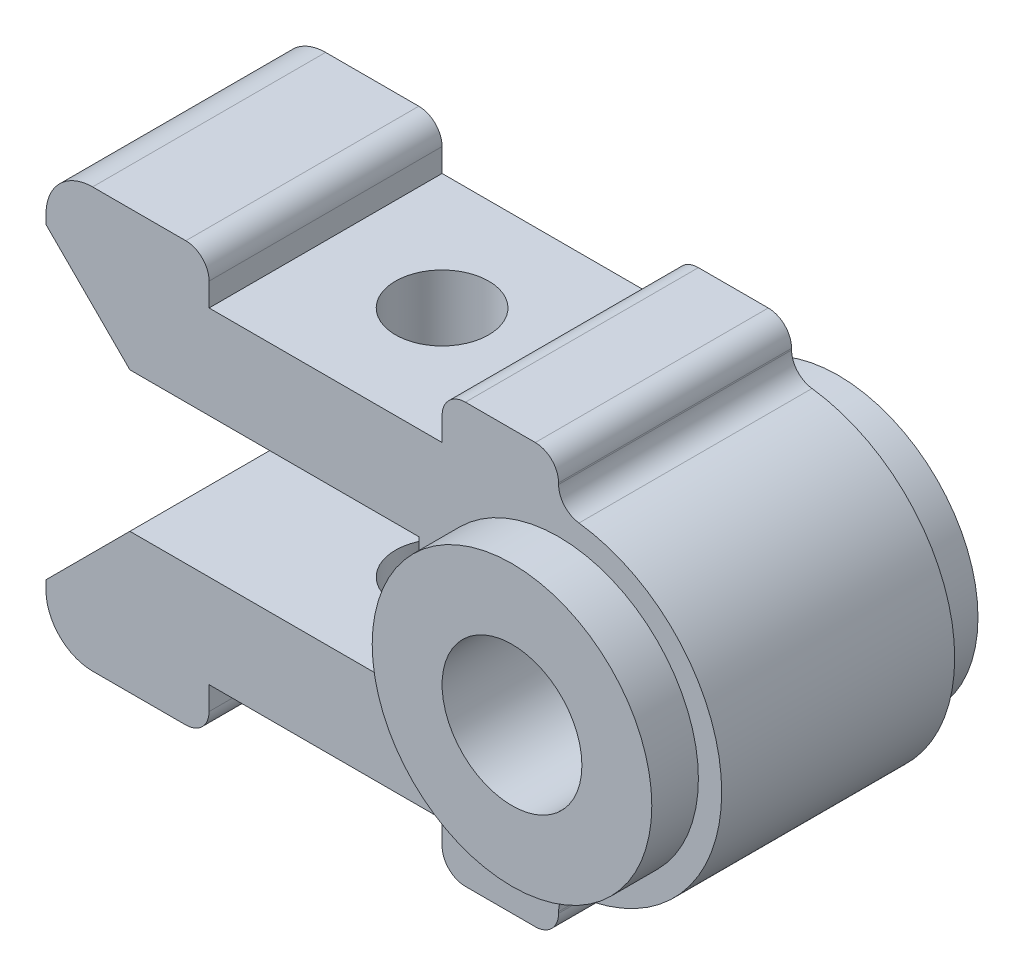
ISO-10303-21;
HEADER;
FILE_DESCRIPTION(('STEP AP214'),'2;1');
FILE_NAME('part.step','',(''),(''),'','','');
FILE_SCHEMA(('AUTOMOTIVE_DESIGN { 1 0 10303 214 1 1 1 1 }'));
ENDSEC;
DATA;
#1=APPLICATION_CONTEXT('core data for automotive mechanical design processes');
#2=APPLICATION_PROTOCOL_DEFINITION('international standard','automotive_design',2000,#1);
#3=PRODUCT_CONTEXT('',#1,'mechanical');
#4=PRODUCT('Part','Part','',(#3));
#5=PRODUCT_RELATED_PRODUCT_CATEGORY('part','',(#4));
#6=PRODUCT_DEFINITION_FORMATION('','',#4);
#7=PRODUCT_DEFINITION_CONTEXT('part definition',#1,'design');
#8=PRODUCT_DEFINITION('design','',#6,#7);
#9=PRODUCT_DEFINITION_SHAPE('','',#8);
#10=(LENGTH_UNIT() NAMED_UNIT(*) SI_UNIT(.MILLI.,.METRE.));
#11=(NAMED_UNIT(*) PLANE_ANGLE_UNIT() SI_UNIT($,.RADIAN.));
#12=(NAMED_UNIT(*) SI_UNIT($,.STERADIAN.) SOLID_ANGLE_UNIT());
#13=UNCERTAINTY_MEASURE_WITH_UNIT(LENGTH_MEASURE(1.E-05),#10,'distance_accuracy_value','');
#14=(GEOMETRIC_REPRESENTATION_CONTEXT(3) GLOBAL_UNCERTAINTY_ASSIGNED_CONTEXT((#13)) GLOBAL_UNIT_ASSIGNED_CONTEXT((#10,
#11,#12)) REPRESENTATION_CONTEXT('',''));
#15=CARTESIAN_POINT('',(0.,0.,0.));
#16=DIRECTION('',(0.,0.,1.));
#17=DIRECTION('',(1.,0.,0.));
#18=AXIS2_PLACEMENT_3D('',#15,#16,#17);
#19=CARTESIAN_POINT('',(0.,0.,2.5));
#20=DIRECTION('',(0.,0.,1.));
#21=DIRECTION('',(1.,0.,0.));
#22=AXIS2_PLACEMENT_3D('',#19,#20,#21);
#23=PLANE('',#22);
#24=DIRECTION('',(0.,-1.,0.));
#25=VECTOR('',#24,1.);
#26=CARTESIAN_POINT('',(2.5,0.,2.5));
#27=LINE('',#26,#25);
#28=CARTESIAN_POINT('',(2.5,1.5,2.5));
#29=VERTEX_POINT('',#28);
#30=CARTESIAN_POINT('',(2.5,0.,2.5));
#31=VERTEX_POINT('',#30);
#32=EDGE_CURVE('E310',#29,#31,#27,.T.);
#33=ORIENTED_EDGE('',*,*,#32,.T.);
#34=CARTESIAN_POINT('',(5.5,0.,2.5));
#35=DIRECTION('',(0.,0.,1.));
#36=DIRECTION('',(1.,0.,0.));
#37=AXIS2_PLACEMENT_3D('',#34,#35,#36);
#38=CIRCLE('',#37,3.);
#39=EDGE_CURVE('E60',#31,#31,#38,.T.);
#40=ORIENTED_EDGE('',*,*,#39,.F.);
#41=CARTESIAN_POINT('',(2.5,-1.5,2.5));
#42=VERTEX_POINT('',#41);
#43=EDGE_CURVE('E309',#31,#42,#27,.T.);
#44=ORIENTED_EDGE('',*,*,#43,.T.);
#45=DIRECTION('',(1.,0.,0.));
#46=VECTOR('',#45,1.);
#47=CARTESIAN_POINT('',(0.,-1.5,2.5));
#48=LINE('',#47,#46);
#49=CARTESIAN_POINT('',(-3.70000000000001,-1.5,2.5));
#50=VERTEX_POINT('',#49);
#51=EDGE_CURVE('E313',#50,#42,#48,.T.);
#52=ORIENTED_EDGE('',*,*,#51,.F.);
#53=DIRECTION('',(0.707106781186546,0.707106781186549,0.));
#54=VECTOR('',#53,1.);
#55=CARTESIAN_POINT('',(-1.10000000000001,1.10000000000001,2.5));
#56=LINE('',#55,#54);
#57=CARTESIAN_POINT('',(-5.5,-3.3,2.5));
#58=VERTEX_POINT('',#57);
#59=EDGE_CURVE('E316',#58,#50,#56,.T.);
#60=ORIENTED_EDGE('',*,*,#59,.F.);
#61=DIRECTION('',(0.,-1.,0.));
#62=VECTOR('',#61,1.);
#63=CARTESIAN_POINT('',(-5.5,0.,2.5));
#64=LINE('',#63,#62);
#65=CARTESIAN_POINT('',(-5.5,-3.5,2.5));
#66=VERTEX_POINT('',#65);
#67=EDGE_CURVE('E319',#58,#66,#64,.T.);
#68=ORIENTED_EDGE('',*,*,#67,.T.);
#69=CARTESIAN_POINT('',(-4.5,-3.5,2.5));
#70=DIRECTION('',(0.,0.,1.));
#71=DIRECTION('',(1.,0.,0.));
#72=AXIS2_PLACEMENT_3D('',#69,#70,#71);
#73=CIRCLE('',#72,1.);
#74=CARTESIAN_POINT('',(-4.5,-4.5,2.5));
#75=VERTEX_POINT('',#74);
#76=EDGE_CURVE('E402',#66,#75,#73,.T.);
#77=ORIENTED_EDGE('',*,*,#76,.T.);
#78=DIRECTION('',(-1.,0.,0.));
#79=VECTOR('',#78,1.);
#80=CARTESIAN_POINT('',(0.,-4.5,2.5));
#81=LINE('',#80,#79);
#82=CARTESIAN_POINT('',(-2.5,-4.5,2.5));
#83=VERTEX_POINT('',#82);
#84=EDGE_CURVE('E322',#83,#75,#81,.T.);
#85=ORIENTED_EDGE('',*,*,#84,.F.);
#86=CARTESIAN_POINT('',(-2.5,-4.,2.5));
#87=DIRECTION('',(0.,0.,1.));
#88=DIRECTION('',(1.,0.,0.));
#89=AXIS2_PLACEMENT_3D('',#86,#87,#88);
#90=CIRCLE('',#89,0.5);
#91=CARTESIAN_POINT('',(-2.,-4.,2.5));
#92=VERTEX_POINT('',#91);
#93=EDGE_CURVE('E438',#83,#92,#90,.T.);
#94=ORIENTED_EDGE('',*,*,#93,.T.);
#95=DIRECTION('',(0.,-1.,0.));
#96=VECTOR('',#95,1.);
#97=CARTESIAN_POINT('',(-2.,-4.5,2.5));
#98=LINE('',#97,#96);
#99=CARTESIAN_POINT('',(-2.,-3.5,2.5));
#100=VERTEX_POINT('',#99);
#101=EDGE_CURVE('E292',#100,#92,#98,.T.);
#102=ORIENTED_EDGE('',*,*,#101,.F.);
#103=DIRECTION('',(-1.,0.,0.));
#104=VECTOR('',#103,1.);
#105=CARTESIAN_POINT('',(-2.,-3.5,2.5));
#106=LINE('',#105,#104);
#107=CARTESIAN_POINT('',(3.,-3.5,2.5));
#108=VERTEX_POINT('',#107);
#109=EDGE_CURVE('E286',#108,#100,#106,.T.);
#110=ORIENTED_EDGE('',*,*,#109,.F.);
#111=DIRECTION('',(0.,1.,0.));
#112=VECTOR('',#111,1.);
#113=CARTESIAN_POINT('',(3.,-4.5,2.5));
#114=LINE('',#113,#112);
#115=CARTESIAN_POINT('',(3.,-4.,2.5));
#116=VERTEX_POINT('',#115);
#117=EDGE_CURVE('E295',#116,#108,#114,.T.);
#118=ORIENTED_EDGE('',*,*,#117,.F.);
#119=CARTESIAN_POINT('',(3.5,-4.,2.5));
#120=DIRECTION('',(0.,0.,1.));
#121=DIRECTION('',(1.,0.,0.));
#122=AXIS2_PLACEMENT_3D('',#119,#120,#121);
#123=CIRCLE('',#122,0.5);
#124=CARTESIAN_POINT('',(3.5,-4.5,2.5));
#125=VERTEX_POINT('',#124);
#126=EDGE_CURVE('E436',#116,#125,#123,.T.);
#127=ORIENTED_EDGE('',*,*,#126,.T.);
#128=CARTESIAN_POINT('',(5.,-4.5,2.5));
#129=VERTEX_POINT('',#128);
#130=EDGE_CURVE('E324',#129,#125,#81,.T.);
#131=ORIENTED_EDGE('',*,*,#130,.F.);
#132=CARTESIAN_POINT('',(5.,-4.,2.5));
#133=DIRECTION('',(0.,0.,1.));
#134=DIRECTION('',(1.,0.,0.));
#135=AXIS2_PLACEMENT_3D('',#132,#133,#134);
#136=CIRCLE('',#135,0.5);
#137=CARTESIAN_POINT('',(5.5,-4.,2.5));
#138=VERTEX_POINT('',#137);
#139=EDGE_CURVE('E446',#129,#138,#136,.T.);
#140=ORIENTED_EDGE('',*,*,#139,.T.);
#141=DIRECTION('',(0.,-1.,0.));
#142=VECTOR('',#141,1.);
#143=CARTESIAN_POINT('',(5.5,0.,2.5));
#144=LINE('',#143,#142);
#145=CARTESIAN_POINT('',(5.5,-3.96862696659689,2.5));
#146=VERTEX_POINT('',#145);
#147=EDGE_CURVE('E325',#146,#138,#144,.T.);
#148=ORIENTED_EDGE('',*,*,#147,.F.);
#149=CARTESIAN_POINT('',(6.,-3.96862696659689,2.5));
#150=DIRECTION('',(0.,0.,1.));
#151=DIRECTION('',(1.,0.,0.));
#152=AXIS2_PLACEMENT_3D('',#149,#150,#151);
#153=CIRCLE('',#152,0.5);
#154=CARTESIAN_POINT('',(5.9375,-3.47254859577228,2.5));
#155=VERTEX_POINT('',#154);
#156=EDGE_CURVE('E480',#146,#155,#153,.F.);
#157=ORIENTED_EDGE('',*,*,#156,.T.);
#158=CARTESIAN_POINT('',(5.5,0.,2.5));
#159=DIRECTION('',(0.,0.,1.));
#160=DIRECTION('',(1.,0.,0.));
#161=AXIS2_PLACEMENT_3D('',#158,#159,#160);
#162=CIRCLE('',#161,3.5);
#163=CARTESIAN_POINT('',(5.9375,3.47254859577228,2.5));
#164=VERTEX_POINT('',#163);
#165=EDGE_CURVE('E328',#155,#164,#162,.T.);
#166=ORIENTED_EDGE('',*,*,#165,.T.);
#167=CARTESIAN_POINT('',(6.,3.96862696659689,2.5));
#168=DIRECTION('',(0.,0.,1.));
#169=DIRECTION('',(1.,0.,0.));
#170=AXIS2_PLACEMENT_3D('',#167,#168,#169);
#171=CIRCLE('',#170,0.5);
#172=CARTESIAN_POINT('',(5.5,3.96862696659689,2.5));
#173=VERTEX_POINT('',#172);
#174=EDGE_CURVE('E11',#164,#173,#171,.F.);
#175=ORIENTED_EDGE('',*,*,#174,.T.);
#176=DIRECTION('',(0.,-1.,0.));
#177=VECTOR('',#176,1.);
#178=CARTESIAN_POINT('',(5.5,0.,2.5));
#179=LINE('',#178,#177);
#180=CARTESIAN_POINT('',(5.5,4.,2.5));
#181=VERTEX_POINT('',#180);
#182=EDGE_CURVE('E331',#181,#173,#179,.T.);
#183=ORIENTED_EDGE('',*,*,#182,.F.);
#184=CARTESIAN_POINT('',(5.,4.,2.5));
#185=DIRECTION('',(0.,0.,1.));
#186=DIRECTION('',(1.,0.,0.));
#187=AXIS2_PLACEMENT_3D('',#184,#185,#186);
#188=CIRCLE('',#187,0.5);
#189=CARTESIAN_POINT('',(5.,4.5,2.5));
#190=VERTEX_POINT('',#189);
#191=EDGE_CURVE('E444',#181,#190,#188,.T.);
#192=ORIENTED_EDGE('',*,*,#191,.T.);
#193=DIRECTION('',(-1.,0.,0.));
#194=VECTOR('',#193,1.);
#195=CARTESIAN_POINT('',(0.,4.5,2.5));
#196=LINE('',#195,#194);
#197=CARTESIAN_POINT('',(3.5,4.5,2.5));
#198=VERTEX_POINT('',#197);
#199=EDGE_CURVE('E335',#190,#198,#196,.T.);
#200=ORIENTED_EDGE('',*,*,#199,.T.);
#201=CARTESIAN_POINT('',(3.5,4.,2.5));
#202=DIRECTION('',(0.,0.,1.));
#203=DIRECTION('',(1.,0.,0.));
#204=AXIS2_PLACEMENT_3D('',#201,#202,#203);
#205=CIRCLE('',#204,0.5);
#206=CARTESIAN_POINT('',(3.,4.,2.5));
#207=VERTEX_POINT('',#206);
#208=EDGE_CURVE('E440',#198,#207,#205,.T.);
#209=ORIENTED_EDGE('',*,*,#208,.T.);
#210=DIRECTION('',(0.,1.,0.));
#211=VECTOR('',#210,1.);
#212=CARTESIAN_POINT('',(3.,4.5,2.5));
#213=LINE('',#212,#211);
#214=CARTESIAN_POINT('',(3.,3.5,2.5));
#215=VERTEX_POINT('',#214);
#216=EDGE_CURVE('E255',#215,#207,#213,.T.);
#217=ORIENTED_EDGE('',*,*,#216,.F.);
#218=DIRECTION('',(1.,0.,0.));
#219=VECTOR('',#218,1.);
#220=CARTESIAN_POINT('',(-2.,3.5,2.5));
#221=LINE('',#220,#219);
#222=CARTESIAN_POINT('',(-2.,3.5,2.5));
#223=VERTEX_POINT('',#222);
#224=EDGE_CURVE('E275',#223,#215,#221,.T.);
#225=ORIENTED_EDGE('',*,*,#224,.F.);
#226=DIRECTION('',(0.,-1.,0.));
#227=VECTOR('',#226,1.);
#228=CARTESIAN_POINT('',(-2.,4.5,2.5));
#229=LINE('',#228,#227);
#230=CARTESIAN_POINT('',(-2.,4.,2.5));
#231=VERTEX_POINT('',#230);
#232=EDGE_CURVE('E261',#231,#223,#229,.T.);
#233=ORIENTED_EDGE('',*,*,#232,.F.);
#234=CARTESIAN_POINT('',(-2.5,4.,2.5));
#235=DIRECTION('',(0.,0.,1.));
#236=DIRECTION('',(1.,0.,0.));
#237=AXIS2_PLACEMENT_3D('',#234,#235,#236);
#238=CIRCLE('',#237,0.5);
#239=CARTESIAN_POINT('',(-2.5,4.5,2.5));
#240=VERTEX_POINT('',#239);
#241=EDGE_CURVE('E442',#231,#240,#238,.T.);
#242=ORIENTED_EDGE('',*,*,#241,.T.);
#243=CARTESIAN_POINT('',(-4.5,4.5,2.5));
#244=VERTEX_POINT('',#243);
#245=EDGE_CURVE('E334',#240,#244,#196,.T.);
#246=ORIENTED_EDGE('',*,*,#245,.T.);
#247=CARTESIAN_POINT('',(-4.5,3.5,2.5));
#248=DIRECTION('',(0.,0.,1.));
#249=DIRECTION('',(1.,0.,0.));
#250=AXIS2_PLACEMENT_3D('',#247,#248,#249);
#251=CIRCLE('',#250,1.);
#252=CARTESIAN_POINT('',(-5.5,3.5,2.5));
#253=VERTEX_POINT('',#252);
#254=EDGE_CURVE('E400',#244,#253,#251,.T.);
#255=ORIENTED_EDGE('',*,*,#254,.T.);
#256=DIRECTION('',(0.,-1.,0.));
#257=VECTOR('',#256,1.);
#258=CARTESIAN_POINT('',(-5.5,0.,2.5));
#259=LINE('',#258,#257);
#260=CARTESIAN_POINT('',(-5.5,3.29999999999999,2.5));
#261=VERTEX_POINT('',#260);
#262=EDGE_CURVE('E338',#253,#261,#259,.T.);
#263=ORIENTED_EDGE('',*,*,#262,.T.);
#264=DIRECTION('',(0.707106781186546,-0.707106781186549,0.));
#265=VECTOR('',#264,1.);
#266=CARTESIAN_POINT('',(-1.10000000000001,-1.10000000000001,2.5));
#267=LINE('',#266,#265);
#268=CARTESIAN_POINT('',(-3.70000000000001,1.5,2.5));
#269=VERTEX_POINT('',#268);
#270=EDGE_CURVE('E303',#261,#269,#267,.T.);
#271=ORIENTED_EDGE('',*,*,#270,.T.);
#272=DIRECTION('',(1.,0.,0.));
#273=VECTOR('',#272,1.);
#274=CARTESIAN_POINT('',(0.,1.5,2.5));
#275=LINE('',#274,#273);
#276=EDGE_CURVE('E306',#269,#29,#275,.T.);
#277=ORIENTED_EDGE('',*,*,#276,.T.);
#278=EDGE_LOOP('',(#33,#40,#44,#52,#60,#68,#77,#85,#94,#102,#110,#118,#127,#131,#140,#148,#157,
#166,#175,#183,#192,#200,#209,#217,#225,#233,#242,#246,#255,#263,#271,#277));
#279=FACE_BOUND('',#278,.T.);
#280=ADVANCED_FACE('F42',(#279),#23,.T.);
#281=CARTESIAN_POINT('',(0.,-4.5,2.5));
#282=DIRECTION('',(0.,-1.,0.));
#283=DIRECTION('',(0.,0.,-1.));
#284=AXIS2_PLACEMENT_3D('',#281,#282,#283);
#285=PLANE('',#284);
#286=DIRECTION('',(-1.,0.,0.));
#287=VECTOR('',#286,1.);
#288=CARTESIAN_POINT('',(0.,-4.5,-2.5));
#289=LINE('',#288,#287);
#290=CARTESIAN_POINT('',(-2.5,-4.5,-2.5));
#291=VERTEX_POINT('',#290);
#292=CARTESIAN_POINT('',(-4.5,-4.5,-2.5));
#293=VERTEX_POINT('',#292);
#294=EDGE_CURVE('E358',#291,#293,#289,.T.);
#295=ORIENTED_EDGE('',*,*,#294,.F.);
#296=DIRECTION('',(0.,0.,1.));
#297=VECTOR('',#296,1.);
#298=CARTESIAN_POINT('',(-2.5,-4.5,2.5));
#299=LINE('',#298,#297);
#300=EDGE_CURVE('E470',#291,#83,#299,.T.);
#301=ORIENTED_EDGE('',*,*,#300,.T.);
#302=ORIENTED_EDGE('',*,*,#84,.T.);
#303=DIRECTION('',(0.,0.,-1.));
#304=VECTOR('',#303,1.);
#305=CARTESIAN_POINT('',(-4.5,-4.5,-2.5));
#306=LINE('',#305,#304);
#307=EDGE_CURVE('E390',#75,#293,#306,.T.);
#308=ORIENTED_EDGE('',*,*,#307,.T.);
#309=EDGE_LOOP('',(#295,#301,#302,#308));
#310=FACE_BOUND('',#309,.T.);
#311=ADVANCED_FACE('F532',(#310),#285,.T.);
#312=CARTESIAN_POINT('',(0.,4.5,2.5));
#313=DIRECTION('',(0.,-1.,0.));
#314=DIRECTION('',(1.,0.,0.));
#315=AXIS2_PLACEMENT_3D('',#312,#313,#314);
#316=PLANE('',#315);
#317=ORIENTED_EDGE('',*,*,#245,.F.);
#318=DIRECTION('',(0.,0.,1.));
#319=VECTOR('',#318,1.);
#320=CARTESIAN_POINT('',(-2.5,4.5,2.5));
#321=LINE('',#320,#319);
#322=CARTESIAN_POINT('',(-2.5,4.5,-2.5));
#323=VERTEX_POINT('',#322);
#324=EDGE_CURVE('E466',#240,#323,#321,.F.);
#325=ORIENTED_EDGE('',*,*,#324,.T.);
#326=DIRECTION('',(-1.,0.,0.));
#327=VECTOR('',#326,1.);
#328=CARTESIAN_POINT('',(0.,4.5,-2.5));
#329=LINE('',#328,#327);
#330=CARTESIAN_POINT('',(-4.5,4.5,-2.5));
#331=VERTEX_POINT('',#330);
#332=EDGE_CURVE('E370',#323,#331,#329,.T.);
#333=ORIENTED_EDGE('',*,*,#332,.T.);
#334=DIRECTION('',(0.,0.,-1.));
#335=VECTOR('',#334,1.);
#336=CARTESIAN_POINT('',(-4.5,4.5,2.5));
#337=LINE('',#336,#335);
#338=EDGE_CURVE('E408',#331,#244,#337,.F.);
#339=ORIENTED_EDGE('',*,*,#338,.T.);
#340=EDGE_LOOP('',(#317,#325,#333,#339));
#341=FACE_BOUND('',#340,.T.);
#342=ADVANCED_FACE('F517',(#341),#316,.F.);
#343=CARTESIAN_POINT('',(-1.10000000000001,-1.10000000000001,2.5));
#344=DIRECTION('',(0.707106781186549,0.707106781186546,0.));
#345=DIRECTION('',(-0.707106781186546,0.707106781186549,0.));
#346=AXIS2_PLACEMENT_3D('',#343,#344,#345);
#347=PLANE('',#346);
#348=DIRECTION('',(0.707106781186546,-0.707106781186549,0.));
#349=VECTOR('',#348,1.);
#350=CARTESIAN_POINT('',(-1.10000000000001,-1.10000000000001,-2.5));
#351=LINE('',#350,#349);
#352=CARTESIAN_POINT('',(-5.5,3.29999999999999,-2.5));
#353=VERTEX_POINT('',#352);
#354=CARTESIAN_POINT('',(-3.70000000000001,1.5,-2.5));
#355=VERTEX_POINT('',#354);
#356=EDGE_CURVE('E280',#353,#355,#351,.T.);
#357=ORIENTED_EDGE('',*,*,#356,.T.);
#358=DIRECTION('',(0.,0.,-1.));
#359=VECTOR('',#358,1.);
#360=CARTESIAN_POINT('',(-3.70000000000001,1.5,2.5));
#361=LINE('',#360,#359);
#362=EDGE_CURVE('E387',#269,#355,#361,.T.);
#363=ORIENTED_EDGE('',*,*,#362,.F.);
#364=ORIENTED_EDGE('',*,*,#270,.F.);
#365=DIRECTION('',(0.,0.,-1.));
#366=VECTOR('',#365,1.);
#367=CARTESIAN_POINT('',(-5.5,3.29999999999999,2.5));
#368=LINE('',#367,#366);
#369=EDGE_CURVE('E340',#261,#353,#368,.T.);
#370=ORIENTED_EDGE('',*,*,#369,.T.);
#371=EDGE_LOOP('',(#357,#363,#364,#370));
#372=FACE_BOUND('',#371,.T.);
#373=ADVANCED_FACE('F583',(#372),#347,.F.);
#374=CARTESIAN_POINT('',(0.,1.5,2.5));
#375=DIRECTION('',(0.,1.,0.));
#376=DIRECTION('',(0.,0.,1.));
#377=AXIS2_PLACEMENT_3D('',#374,#375,#376);
#378=PLANE('',#377);
#379=CARTESIAN_POINT('',(0.5,1.5,0.));
#380=DIRECTION('',(0.,1.,0.));
#381=DIRECTION('',(0.,0.,1.));
#382=AXIS2_PLACEMENT_3D('',#379,#380,#381);
#383=CIRCLE('',#382,1.);
#384=CARTESIAN_POINT('',(0.5,1.5,1.));
#385=VERTEX_POINT('',#384);
#386=EDGE_CURVE('E296',#385,#385,#383,.T.);
#387=ORIENTED_EDGE('',*,*,#386,.T.);
#388=EDGE_LOOP('',(#387));
#389=FACE_BOUND('',#388,.T.);
#390=DIRECTION('',(1.,0.,0.));
#391=VECTOR('',#390,1.);
#392=CARTESIAN_POINT('',(0.,1.5,-2.5));
#393=LINE('',#392,#391);
#394=CARTESIAN_POINT('',(2.5,1.5,-2.5));
#395=VERTEX_POINT('',#394);
#396=EDGE_CURVE('E343',#355,#395,#393,.T.);
#397=ORIENTED_EDGE('',*,*,#396,.T.);
#398=DIRECTION('',(0.,0.,-1.));
#399=VECTOR('',#398,1.);
#400=CARTESIAN_POINT('',(2.5,1.5,2.5));
#401=LINE('',#400,#399);
#402=EDGE_CURVE('E384',#29,#395,#401,.T.);
#403=ORIENTED_EDGE('',*,*,#402,.F.);
#404=ORIENTED_EDGE('',*,*,#276,.F.);
#405=ORIENTED_EDGE('',*,*,#362,.T.);
#406=EDGE_LOOP('',(#397,#403,#404,#405));
#407=FACE_BOUND('',#406,.T.);
#408=ADVANCED_FACE('F579',(#389,#407),#378,.F.);
#409=CARTESIAN_POINT('',(2.5,0.,2.5));
#410=DIRECTION('',(1.,0.,0.));
#411=DIRECTION('',(0.,0.,-1.));
#412=AXIS2_PLACEMENT_3D('',#409,#410,#411);
#413=PLANE('',#412);
#414=DIRECTION('',(0.,-1.,0.));
#415=VECTOR('',#414,1.);
#416=CARTESIAN_POINT('',(2.5,0.,-2.5));
#417=LINE('',#416,#415);
#418=CARTESIAN_POINT('',(2.5,0.,-2.5));
#419=VERTEX_POINT('',#418);
#420=EDGE_CURVE('E346',#395,#419,#417,.T.);
#421=ORIENTED_EDGE('',*,*,#420,.T.);
#422=CARTESIAN_POINT('',(2.5,-1.5,-2.5));
#423=VERTEX_POINT('',#422);
#424=EDGE_CURVE('E345',#419,#423,#417,.T.);
#425=ORIENTED_EDGE('',*,*,#424,.T.);
#426=DIRECTION('',(0.,0.,-1.));
#427=VECTOR('',#426,1.);
#428=CARTESIAN_POINT('',(2.5,-1.5,2.5));
#429=LINE('',#428,#427);
#430=EDGE_CURVE('E381',#42,#423,#429,.T.);
#431=ORIENTED_EDGE('',*,*,#430,.F.);
#432=ORIENTED_EDGE('',*,*,#43,.F.);
#433=ORIENTED_EDGE('',*,*,#32,.F.);
#434=ORIENTED_EDGE('',*,*,#402,.T.);
#435=EDGE_LOOP('',(#421,#425,#431,#432,#433,#434));
#436=FACE_BOUND('',#435,.T.);
#437=ADVANCED_FACE('F575',(#436),#413,.F.);
#438=CARTESIAN_POINT('',(0.,-1.5,2.5));
#439=DIRECTION('',(0.,1.,0.));
#440=DIRECTION('',(0.,0.,1.));
#441=AXIS2_PLACEMENT_3D('',#438,#439,#440);
#442=PLANE('',#441);
#443=CARTESIAN_POINT('',(0.5,-1.5,0.));
#444=DIRECTION('',(0.,1.,0.));
#445=DIRECTION('',(0.,0.,1.));
#446=AXIS2_PLACEMENT_3D('',#443,#444,#445);
#447=CIRCLE('',#446,1.);
#448=CARTESIAN_POINT('',(0.5,-1.5,1.));
#449=VERTEX_POINT('',#448);
#450=EDGE_CURVE('E675',#449,#449,#447,.T.);
#451=ORIENTED_EDGE('',*,*,#450,.F.);
#452=EDGE_LOOP('',(#451));
#453=FACE_BOUND('',#452,.T.);
#454=DIRECTION('',(1.,0.,0.));
#455=VECTOR('',#454,1.);
#456=CARTESIAN_POINT('',(0.,-1.5,-2.5));
#457=LINE('',#456,#455);
#458=CARTESIAN_POINT('',(-3.70000000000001,-1.5,-2.5));
#459=VERTEX_POINT('',#458);
#460=EDGE_CURVE('E349',#459,#423,#457,.T.);
#461=ORIENTED_EDGE('',*,*,#460,.F.);
#462=DIRECTION('',(0.,0.,-1.));
#463=VECTOR('',#462,1.);
#464=CARTESIAN_POINT('',(-3.70000000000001,-1.5,2.5));
#465=LINE('',#464,#463);
#466=EDGE_CURVE('E379',#50,#459,#465,.T.);
#467=ORIENTED_EDGE('',*,*,#466,.F.);
#468=ORIENTED_EDGE('',*,*,#51,.T.);
#469=ORIENTED_EDGE('',*,*,#430,.T.);
#470=EDGE_LOOP('',(#461,#467,#468,#469));
#471=FACE_BOUND('',#470,.T.);
#472=ADVANCED_FACE('F571',(#453,#471),#442,.T.);
#473=CARTESIAN_POINT('',(-1.10000000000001,1.10000000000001,2.5));
#474=DIRECTION('',(-0.707106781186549,0.707106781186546,0.));
#475=DIRECTION('',(-0.707106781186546,-0.707106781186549,0.));
#476=AXIS2_PLACEMENT_3D('',#473,#474,#475);
#477=PLANE('',#476);
#478=DIRECTION('',(0.707106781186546,0.707106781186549,0.));
#479=VECTOR('',#478,1.);
#480=CARTESIAN_POINT('',(-1.10000000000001,1.10000000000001,-2.5));
#481=LINE('',#480,#479);
#482=CARTESIAN_POINT('',(-5.5,-3.3,-2.5));
#483=VERTEX_POINT('',#482);
#484=EDGE_CURVE('E352',#483,#459,#481,.T.);
#485=ORIENTED_EDGE('',*,*,#484,.F.);
#486=DIRECTION('',(0.,0.,-1.));
#487=VECTOR('',#486,1.);
#488=CARTESIAN_POINT('',(-5.5,-3.3,2.5));
#489=LINE('',#488,#487);
#490=EDGE_CURVE('E377',#58,#483,#489,.T.);
#491=ORIENTED_EDGE('',*,*,#490,.F.);
#492=ORIENTED_EDGE('',*,*,#59,.T.);
#493=ORIENTED_EDGE('',*,*,#466,.T.);
#494=EDGE_LOOP('',(#485,#491,#492,#493));
#495=FACE_BOUND('',#494,.T.);
#496=ADVANCED_FACE('F567',(#495),#477,.T.);
#497=CARTESIAN_POINT('',(-5.5,0.,2.5));
#498=DIRECTION('',(1.,0.,0.));
#499=DIRECTION('',(0.,1.,0.));
#500=AXIS2_PLACEMENT_3D('',#497,#498,#499);
#501=PLANE('',#500);
#502=DIRECTION('',(0.,-1.,0.));
#503=VECTOR('',#502,1.);
#504=CARTESIAN_POINT('',(-5.5,0.,-2.5));
#505=LINE('',#504,#503);
#506=CARTESIAN_POINT('',(-5.5,-3.5,-2.5));
#507=VERTEX_POINT('',#506);
#508=EDGE_CURVE('E355',#483,#507,#505,.T.);
#509=ORIENTED_EDGE('',*,*,#508,.T.);
#510=DIRECTION('',(0.,0.,-1.));
#511=VECTOR('',#510,1.);
#512=CARTESIAN_POINT('',(-5.5,-3.5,2.5));
#513=LINE('',#512,#511);
#514=EDGE_CURVE('E398',#507,#66,#513,.F.);
#515=ORIENTED_EDGE('',*,*,#514,.T.);
#516=ORIENTED_EDGE('',*,*,#67,.F.);
#517=ORIENTED_EDGE('',*,*,#490,.T.);
#518=EDGE_LOOP('',(#509,#515,#516,#517));
#519=FACE_BOUND('',#518,.T.);
#520=ADVANCED_FACE('F563',(#519),#501,.F.);
#521=CARTESIAN_POINT('',(5.,-4.5,-2.5));
#522=VERTEX_POINT('',#521);
#523=CARTESIAN_POINT('',(3.5,-4.5,-2.5));
#524=VERTEX_POINT('',#523);
#525=EDGE_CURVE('E360',#522,#524,#289,.T.);
#526=ORIENTED_EDGE('',*,*,#525,.F.);
#527=DIRECTION('',(0.,0.,-1.));
#528=VECTOR('',#527,1.);
#529=CARTESIAN_POINT('',(5.,-4.5,2.5));
#530=LINE('',#529,#528);
#531=EDGE_CURVE('E434',#522,#129,#530,.F.);
#532=ORIENTED_EDGE('',*,*,#531,.T.);
#533=ORIENTED_EDGE('',*,*,#130,.T.);
#534=DIRECTION('',(0.,0.,1.));
#535=VECTOR('',#534,1.);
#536=CARTESIAN_POINT('',(3.5,-4.5,-2.5));
#537=LINE('',#536,#535);
#538=EDGE_CURVE('E432',#125,#524,#537,.F.);
#539=ORIENTED_EDGE('',*,*,#538,.T.);
#540=EDGE_LOOP('',(#526,#532,#533,#539));
#541=FACE_BOUND('',#540,.T.);
#542=ADVANCED_FACE('F539',(#541),#285,.T.);
#543=CARTESIAN_POINT('',(5.5,0.,2.5));
#544=DIRECTION('',(1.,0.,0.));
#545=DIRECTION('',(0.,0.,-1.));
#546=AXIS2_PLACEMENT_3D('',#543,#544,#545);
#547=PLANE('',#546);
#548=ORIENTED_EDGE('',*,*,#147,.T.);
#549=DIRECTION('',(0.,0.,-1.));
#550=VECTOR('',#549,1.);
#551=CARTESIAN_POINT('',(5.5,-4.,2.5));
#552=LINE('',#551,#550);
#553=CARTESIAN_POINT('',(5.5,-4.,-2.5));
#554=VERTEX_POINT('',#553);
#555=EDGE_CURVE('E418',#138,#554,#552,.T.);
#556=ORIENTED_EDGE('',*,*,#555,.T.);
#557=DIRECTION('',(0.,-1.,0.));
#558=VECTOR('',#557,1.);
#559=CARTESIAN_POINT('',(5.5,0.,-2.5));
#560=LINE('',#559,#558);
#561=CARTESIAN_POINT('',(5.5,-3.96862696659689,-2.5));
#562=VERTEX_POINT('',#561);
#563=EDGE_CURVE('E361',#562,#554,#560,.T.);
#564=ORIENTED_EDGE('',*,*,#563,.F.);
#565=DIRECTION('',(0.,0.,-1.));
#566=VECTOR('',#565,1.);
#567=CARTESIAN_POINT('',(5.5,-3.96862696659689,2.5));
#568=LINE('',#567,#566);
#569=EDGE_CURVE('E411',#562,#146,#568,.F.);
#570=ORIENTED_EDGE('',*,*,#569,.T.);
#571=EDGE_LOOP('',(#548,#556,#564,#570));
#572=FACE_BOUND('',#571,.T.);
#573=ADVANCED_FACE('F558',(#572),#547,.T.);
#574=CARTESIAN_POINT('',(5.5,0.,2.5));
#575=DIRECTION('',(0.,0.,-1.));
#576=DIRECTION('',(-1.,0.,0.));
#577=AXIS2_PLACEMENT_3D('',#574,#575,#576);
#578=CYLINDRICAL_SURFACE('',#577,3.5);
#579=ORIENTED_EDGE('',*,*,#165,.F.);
#580=DIRECTION('',(0.,0.,-1.));
#581=VECTOR('',#580,1.);
#582=CARTESIAN_POINT('',(5.9375,-3.47254859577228,2.5));
#583=LINE('',#582,#581);
#584=CARTESIAN_POINT('',(5.9375,-3.47254859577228,-2.5));
#585=VERTEX_POINT('',#584);
#586=EDGE_CURVE('E461',#155,#585,#583,.T.);
#587=ORIENTED_EDGE('',*,*,#586,.T.);
#588=CARTESIAN_POINT('',(5.5,0.,-2.5));
#589=DIRECTION('',(0.,0.,1.));
#590=DIRECTION('',(1.,0.,0.));
#591=AXIS2_PLACEMENT_3D('',#588,#589,#590);
#592=CIRCLE('',#591,3.5);
#593=CARTESIAN_POINT('',(5.9375,3.47254859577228,-2.5));
#594=VERTEX_POINT('',#593);
#595=EDGE_CURVE('E364',#585,#594,#592,.T.);
#596=ORIENTED_EDGE('',*,*,#595,.T.);
#597=DIRECTION('',(0.,0.,-1.));
#598=VECTOR('',#597,1.);
#599=CARTESIAN_POINT('',(5.9375,3.47254859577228,2.5));
#600=LINE('',#599,#598);
#601=EDGE_CURVE('E459',#594,#164,#600,.F.);
#602=ORIENTED_EDGE('',*,*,#601,.T.);
#603=EDGE_LOOP('',(#579,#587,#596,#602));
#604=FACE_BOUND('',#603,.T.);
#605=ADVANCED_FACE('F488',(#604),#578,.T.);
#606=CARTESIAN_POINT('',(5.5,0.,2.5));
#607=DIRECTION('',(1.,0.,0.));
#608=DIRECTION('',(0.,0.,-1.));
#609=AXIS2_PLACEMENT_3D('',#606,#607,#608);
#610=PLANE('',#609);
#611=DIRECTION('',(0.,-1.,0.));
#612=VECTOR('',#611,1.);
#613=CARTESIAN_POINT('',(5.5,0.,-2.5));
#614=LINE('',#613,#612);
#615=CARTESIAN_POINT('',(5.5,4.,-2.5));
#616=VERTEX_POINT('',#615);
#617=CARTESIAN_POINT('',(5.5,3.96862696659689,-2.5));
#618=VERTEX_POINT('',#617);
#619=EDGE_CURVE('E367',#616,#618,#614,.T.);
#620=ORIENTED_EDGE('',*,*,#619,.F.);
#621=DIRECTION('',(0.,0.,-1.));
#622=VECTOR('',#621,1.);
#623=CARTESIAN_POINT('',(5.5,4.,2.5));
#624=LINE('',#623,#622);
#625=EDGE_CURVE('E457',#616,#181,#624,.F.);
#626=ORIENTED_EDGE('',*,*,#625,.T.);
#627=ORIENTED_EDGE('',*,*,#182,.T.);
#628=DIRECTION('',(0.,0.,-1.));
#629=VECTOR('',#628,1.);
#630=CARTESIAN_POINT('',(5.5,3.96862696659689,2.5));
#631=LINE('',#630,#629);
#632=EDGE_CURVE('E454',#173,#618,#631,.T.);
#633=ORIENTED_EDGE('',*,*,#632,.T.);
#634=EDGE_LOOP('',(#620,#626,#627,#633));
#635=FACE_BOUND('',#634,.T.);
#636=ADVANCED_FACE('F496',(#635),#610,.T.);
#637=ORIENTED_EDGE('',*,*,#199,.F.);
#638=DIRECTION('',(0.,0.,-1.));
#639=VECTOR('',#638,1.);
#640=CARTESIAN_POINT('',(5.,4.5,-2.5));
#641=LINE('',#640,#639);
#642=CARTESIAN_POINT('',(5.,4.5,-2.5));
#643=VERTEX_POINT('',#642);
#644=EDGE_CURVE('E451',#190,#643,#641,.T.);
#645=ORIENTED_EDGE('',*,*,#644,.T.);
#646=CARTESIAN_POINT('',(3.5,4.5,-2.5));
#647=VERTEX_POINT('',#646);
#648=EDGE_CURVE('E371',#643,#647,#329,.T.);
#649=ORIENTED_EDGE('',*,*,#648,.T.);
#650=DIRECTION('',(0.,0.,1.));
#651=VECTOR('',#650,1.);
#652=CARTESIAN_POINT('',(3.5,4.5,2.5));
#653=LINE('',#652,#651);
#654=EDGE_CURVE('E448',#647,#198,#653,.T.);
#655=ORIENTED_EDGE('',*,*,#654,.T.);
#656=EDGE_LOOP('',(#637,#645,#649,#655));
#657=FACE_BOUND('',#656,.T.);
#658=ADVANCED_FACE('F503',(#657),#316,.F.);
#659=CARTESIAN_POINT('',(5.5,0.,2.5));
#660=DIRECTION('',(0.,0.,-1.));
#661=DIRECTION('',(-1.,0.,0.));
#662=AXIS2_PLACEMENT_3D('',#659,#660,#661);
#663=CYLINDRICAL_SURFACE('',#662,1.5);
#664=CARTESIAN_POINT('',(5.5,0.,3.5));
#665=DIRECTION('',(0.,0.,1.));
#666=DIRECTION('',(1.,0.,0.));
#667=AXIS2_PLACEMENT_3D('',#664,#665,#666);
#668=CIRCLE('',#667,1.5);
#669=CARTESIAN_POINT('',(6.99999999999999,0.,3.5));
#670=VERTEX_POINT('',#669);
#671=EDGE_CURVE('E663',#670,#670,#668,.T.);
#672=ORIENTED_EDGE('',*,*,#671,.T.);
#673=EDGE_LOOP('',(#672));
#674=FACE_BOUND('',#673,.T.);
#675=CARTESIAN_POINT('',(5.5,0.,-3.5));
#676=DIRECTION('',(0.,0.,1.));
#677=DIRECTION('',(1.,0.,0.));
#678=AXIS2_PLACEMENT_3D('',#675,#676,#677);
#679=CIRCLE('',#678,1.5);
#680=CARTESIAN_POINT('',(6.99999999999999,0.,-3.5));
#681=VERTEX_POINT('',#680);
#682=EDGE_CURVE('E660',#681,#681,#679,.T.);
#683=ORIENTED_EDGE('',*,*,#682,.F.);
#684=EDGE_LOOP('',(#683));
#685=FACE_BOUND('',#684,.T.);
#686=ADVANCED_FACE('F550',(#674,#685),#663,.F.);
#687=CARTESIAN_POINT('',(-5.5,0.,2.5));
#688=DIRECTION('',(1.,0.,0.));
#689=DIRECTION('',(0.,1.,0.));
#690=AXIS2_PLACEMENT_3D('',#687,#688,#689);
#691=PLANE('',#690);
#692=ORIENTED_EDGE('',*,*,#262,.F.);
#693=DIRECTION('',(0.,0.,-1.));
#694=VECTOR('',#693,1.);
#695=CARTESIAN_POINT('',(-5.5,3.5,2.5));
#696=LINE('',#695,#694);
#697=CARTESIAN_POINT('',(-5.5,3.5,-2.5));
#698=VERTEX_POINT('',#697);
#699=EDGE_CURVE('E405',#253,#698,#696,.T.);
#700=ORIENTED_EDGE('',*,*,#699,.T.);
#701=DIRECTION('',(0.,-1.,0.));
#702=VECTOR('',#701,1.);
#703=CARTESIAN_POINT('',(-5.5,0.,-2.5));
#704=LINE('',#703,#702);
#705=EDGE_CURVE('E307',#698,#353,#704,.T.);
#706=ORIENTED_EDGE('',*,*,#705,.T.);
#707=ORIENTED_EDGE('',*,*,#369,.F.);
#708=EDGE_LOOP('',(#692,#700,#706,#707));
#709=FACE_BOUND('',#708,.T.);
#710=ADVANCED_FACE('F547',(#709),#691,.F.);
#711=CARTESIAN_POINT('',(0.,0.,-2.5));
#712=DIRECTION('',(0.,0.,1.));
#713=DIRECTION('',(1.,0.,0.));
#714=AXIS2_PLACEMENT_3D('',#711,#712,#713);
#715=PLANE('',#714);
#716=ORIENTED_EDGE('',*,*,#424,.F.);
#717=CARTESIAN_POINT('',(5.5,0.,-2.5));
#718=DIRECTION('',(0.,0.,1.));
#719=DIRECTION('',(1.,0.,0.));
#720=AXIS2_PLACEMENT_3D('',#717,#718,#719);
#721=CIRCLE('',#720,3.);
#722=EDGE_CURVE('E55',#419,#419,#721,.T.);
#723=ORIENTED_EDGE('',*,*,#722,.T.);
#724=ORIENTED_EDGE('',*,*,#420,.F.);
#725=ORIENTED_EDGE('',*,*,#396,.F.);
#726=ORIENTED_EDGE('',*,*,#356,.F.);
#727=ORIENTED_EDGE('',*,*,#705,.F.);
#728=CARTESIAN_POINT('',(-4.5,3.5,-2.5));
#729=DIRECTION('',(0.,0.,1.));
#730=DIRECTION('',(1.,0.,0.));
#731=AXIS2_PLACEMENT_3D('',#728,#729,#730);
#732=CIRCLE('',#731,1.);
#733=EDGE_CURVE('E393',#698,#331,#732,.F.);
#734=ORIENTED_EDGE('',*,*,#733,.T.);
#735=ORIENTED_EDGE('',*,*,#332,.F.);
#736=CARTESIAN_POINT('',(-2.5,4.,-2.5));
#737=DIRECTION('',(0.,0.,1.));
#738=DIRECTION('',(1.,0.,0.));
#739=AXIS2_PLACEMENT_3D('',#736,#737,#738);
#740=CIRCLE('',#739,0.5);
#741=CARTESIAN_POINT('',(-2.,4.,-2.5));
#742=VERTEX_POINT('',#741);
#743=EDGE_CURVE('E251',#323,#742,#740,.F.);
#744=ORIENTED_EDGE('',*,*,#743,.T.);
#745=DIRECTION('',(0.,-1.,0.));
#746=VECTOR('',#745,1.);
#747=CARTESIAN_POINT('',(-2.,4.5,-2.5));
#748=LINE('',#747,#746);
#749=CARTESIAN_POINT('',(-2.,3.5,-2.5));
#750=VERTEX_POINT('',#749);
#751=EDGE_CURVE('E242',#742,#750,#748,.T.);
#752=ORIENTED_EDGE('',*,*,#751,.T.);
#753=DIRECTION('',(1.,0.,0.));
#754=VECTOR('',#753,1.);
#755=CARTESIAN_POINT('',(-2.,3.5,-2.5));
#756=LINE('',#755,#754);
#757=CARTESIAN_POINT('',(3.,3.5,-2.5));
#758=VERTEX_POINT('',#757);
#759=EDGE_CURVE('E248',#750,#758,#756,.T.);
#760=ORIENTED_EDGE('',*,*,#759,.T.);
#761=DIRECTION('',(0.,1.,0.));
#762=VECTOR('',#761,1.);
#763=CARTESIAN_POINT('',(3.,4.5,-2.5));
#764=LINE('',#763,#762);
#765=CARTESIAN_POINT('',(3.,4.,-2.5));
#766=VERTEX_POINT('',#765);
#767=EDGE_CURVE('E266',#758,#766,#764,.T.);
#768=ORIENTED_EDGE('',*,*,#767,.T.);
#769=CARTESIAN_POINT('',(3.5,4.,-2.5));
#770=DIRECTION('',(0.,0.,1.));
#771=DIRECTION('',(1.,0.,0.));
#772=AXIS2_PLACEMENT_3D('',#769,#770,#771);
#773=CIRCLE('',#772,0.5);
#774=EDGE_CURVE('E425',#766,#647,#773,.F.);
#775=ORIENTED_EDGE('',*,*,#774,.T.);
#776=ORIENTED_EDGE('',*,*,#648,.F.);
#777=CARTESIAN_POINT('',(5.,4.,-2.5));
#778=DIRECTION('',(0.,0.,1.));
#779=DIRECTION('',(1.,0.,0.));
#780=AXIS2_PLACEMENT_3D('',#777,#778,#779);
#781=CIRCLE('',#780,0.5);
#782=EDGE_CURVE('E428',#643,#616,#781,.F.);
#783=ORIENTED_EDGE('',*,*,#782,.T.);
#784=ORIENTED_EDGE('',*,*,#619,.T.);
#785=CARTESIAN_POINT('',(6.,3.96862696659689,-2.5));
#786=DIRECTION('',(0.,0.,1.));
#787=DIRECTION('',(1.,0.,0.));
#788=AXIS2_PLACEMENT_3D('',#785,#786,#787);
#789=CIRCLE('',#788,0.5);
#790=EDGE_CURVE('E50',#618,#594,#789,.T.);
#791=ORIENTED_EDGE('',*,*,#790,.T.);
#792=ORIENTED_EDGE('',*,*,#595,.F.);
#793=CARTESIAN_POINT('',(6.,-3.96862696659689,-2.5));
#794=DIRECTION('',(0.,0.,1.));
#795=DIRECTION('',(1.,0.,0.));
#796=AXIS2_PLACEMENT_3D('',#793,#794,#795);
#797=CIRCLE('',#796,0.5);
#798=EDGE_CURVE('E478',#585,#562,#797,.T.);
#799=ORIENTED_EDGE('',*,*,#798,.T.);
#800=ORIENTED_EDGE('',*,*,#563,.T.);
#801=CARTESIAN_POINT('',(5.,-4.,-2.5));
#802=DIRECTION('',(0.,0.,1.));
#803=DIRECTION('',(1.,0.,0.));
#804=AXIS2_PLACEMENT_3D('',#801,#802,#803);
#805=CIRCLE('',#804,0.5);
#806=EDGE_CURVE('E430',#554,#522,#805,.F.);
#807=ORIENTED_EDGE('',*,*,#806,.T.);
#808=ORIENTED_EDGE('',*,*,#525,.T.);
#809=CARTESIAN_POINT('',(3.5,-4.,-2.5));
#810=DIRECTION('',(0.,0.,1.));
#811=DIRECTION('',(1.,0.,0.));
#812=AXIS2_PLACEMENT_3D('',#809,#810,#811);
#813=CIRCLE('',#812,0.5);
#814=CARTESIAN_POINT('',(3.,-4.,-2.5));
#815=VERTEX_POINT('',#814);
#816=EDGE_CURVE('E421',#524,#815,#813,.F.);
#817=ORIENTED_EDGE('',*,*,#816,.T.);
#818=DIRECTION('',(0.,1.,0.));
#819=VECTOR('',#818,1.);
#820=CARTESIAN_POINT('',(3.,-4.5,-2.5));
#821=LINE('',#820,#819);
#822=CARTESIAN_POINT('',(3.,-3.5,-2.5));
#823=VERTEX_POINT('',#822);
#824=EDGE_CURVE('E285',#815,#823,#821,.T.);
#825=ORIENTED_EDGE('',*,*,#824,.T.);
#826=DIRECTION('',(-1.,0.,0.));
#827=VECTOR('',#826,1.);
#828=CARTESIAN_POINT('',(-2.,-3.5,-2.5));
#829=LINE('',#828,#827);
#830=CARTESIAN_POINT('',(-2.,-3.5,-2.5));
#831=VERTEX_POINT('',#830);
#832=EDGE_CURVE('E288',#823,#831,#829,.T.);
#833=ORIENTED_EDGE('',*,*,#832,.T.);
#834=DIRECTION('',(0.,-1.,0.));
#835=VECTOR('',#834,1.);
#836=CARTESIAN_POINT('',(-2.,-4.5,-2.5));
#837=LINE('',#836,#835);
#838=CARTESIAN_POINT('',(-2.,-4.,-2.5));
#839=VERTEX_POINT('',#838);
#840=EDGE_CURVE('E282',#831,#839,#837,.T.);
#841=ORIENTED_EDGE('',*,*,#840,.T.);
#842=CARTESIAN_POINT('',(-2.5,-4.,-2.5));
#843=DIRECTION('',(0.,0.,1.));
#844=DIRECTION('',(1.,0.,0.));
#845=AXIS2_PLACEMENT_3D('',#842,#843,#844);
#846=CIRCLE('',#845,0.5);
#847=EDGE_CURVE('E423',#839,#291,#846,.F.);
#848=ORIENTED_EDGE('',*,*,#847,.T.);
#849=ORIENTED_EDGE('',*,*,#294,.T.);
#850=CARTESIAN_POINT('',(-4.5,-3.5,-2.5));
#851=DIRECTION('',(0.,0.,1.));
#852=DIRECTION('',(1.,0.,0.));
#853=AXIS2_PLACEMENT_3D('',#850,#851,#852);
#854=CIRCLE('',#853,1.);
#855=EDGE_CURVE('E396',#293,#507,#854,.F.);
#856=ORIENTED_EDGE('',*,*,#855,.T.);
#857=ORIENTED_EDGE('',*,*,#508,.F.);
#858=ORIENTED_EDGE('',*,*,#484,.T.);
#859=ORIENTED_EDGE('',*,*,#460,.T.);
#860=EDGE_LOOP('',(#716,#723,#724,#725,#726,#727,#734,#735,#744,#752,#760,#768,#775,#776,#783,
#784,#791,#792,#799,#800,#807,#808,#817,#825,#833,#841,#848,#849,#856,#857,#858,#859));
#861=FACE_BOUND('',#860,.T.);
#862=ADVANCED_FACE('F245',(#861),#715,.F.);
#863=CARTESIAN_POINT('',(-4.5,-3.5,2.5));
#864=DIRECTION('',(0.,0.,1.));
#865=DIRECTION('',(1.,0.,0.));
#866=AXIS2_PLACEMENT_3D('',#863,#864,#865);
#867=CYLINDRICAL_SURFACE('',#866,1.);
#868=ORIENTED_EDGE('',*,*,#76,.F.);
#869=ORIENTED_EDGE('',*,*,#514,.F.);
#870=ORIENTED_EDGE('',*,*,#855,.F.);
#871=ORIENTED_EDGE('',*,*,#307,.F.);
#872=EDGE_LOOP('',(#868,#869,#870,#871));
#873=FACE_BOUND('',#872,.T.);
#874=ADVANCED_FACE('F546',(#873),#867,.T.);
#875=CARTESIAN_POINT('',(-4.5,3.5,2.5));
#876=DIRECTION('',(0.,0.,-1.));
#877=DIRECTION('',(-1.,0.,0.));
#878=AXIS2_PLACEMENT_3D('',#875,#876,#877);
#879=CYLINDRICAL_SURFACE('',#878,1.);
#880=ORIENTED_EDGE('',*,*,#254,.F.);
#881=ORIENTED_EDGE('',*,*,#338,.F.);
#882=ORIENTED_EDGE('',*,*,#733,.F.);
#883=ORIENTED_EDGE('',*,*,#699,.F.);
#884=EDGE_LOOP('',(#880,#881,#882,#883));
#885=FACE_BOUND('',#884,.T.);
#886=ADVANCED_FACE('F593',(#885),#879,.T.);
#887=CARTESIAN_POINT('',(-2.,-4.5,-2.5));
#888=DIRECTION('',(-1.,0.,0.));
#889=DIRECTION('',(0.,0.,1.));
#890=AXIS2_PLACEMENT_3D('',#887,#888,#889);
#891=PLANE('',#890);
#892=ORIENTED_EDGE('',*,*,#101,.T.);
#893=DIRECTION('',(0.,0.,1.));
#894=VECTOR('',#893,1.);
#895=CARTESIAN_POINT('',(-2.,-4.,-2.5));
#896=LINE('',#895,#894);
#897=EDGE_CURVE('E473',#92,#839,#896,.F.);
#898=ORIENTED_EDGE('',*,*,#897,.T.);
#899=ORIENTED_EDGE('',*,*,#840,.F.);
#900=DIRECTION('',(0.,0.,1.));
#901=VECTOR('',#900,1.);
#902=CARTESIAN_POINT('',(-2.,-3.5,-2.5));
#903=LINE('',#902,#901);
#904=EDGE_CURVE('E276',#831,#100,#903,.T.);
#905=ORIENTED_EDGE('',*,*,#904,.T.);
#906=EDGE_LOOP('',(#892,#898,#899,#905));
#907=FACE_BOUND('',#906,.T.);
#908=ADVANCED_FACE('F542',(#907),#891,.F.);
#909=CARTESIAN_POINT('',(-2.,-3.5,-2.5));
#910=DIRECTION('',(0.,1.,0.));
#911=DIRECTION('',(0.,0.,1.));
#912=AXIS2_PLACEMENT_3D('',#909,#910,#911);
#913=PLANE('',#912);
#914=CARTESIAN_POINT('',(0.5,-3.5,0.));
#915=DIRECTION('',(0.,1.,0.));
#916=DIRECTION('',(0.,0.,1.));
#917=AXIS2_PLACEMENT_3D('',#914,#915,#916);
#918=CIRCLE('',#917,1.);
#919=CARTESIAN_POINT('',(0.5,-3.5,1.));
#920=VERTEX_POINT('',#919);
#921=EDGE_CURVE('E415',#920,#920,#918,.T.);
#922=ORIENTED_EDGE('',*,*,#921,.T.);
#923=EDGE_LOOP('',(#922));
#924=FACE_BOUND('',#923,.T.);
#925=ORIENTED_EDGE('',*,*,#109,.T.);
#926=ORIENTED_EDGE('',*,*,#904,.F.);
#927=ORIENTED_EDGE('',*,*,#832,.F.);
#928=DIRECTION('',(0.,0.,1.));
#929=VECTOR('',#928,1.);
#930=CARTESIAN_POINT('',(3.,-3.5,-2.5));
#931=LINE('',#930,#929);
#932=EDGE_CURVE('E291',#823,#108,#931,.T.);
#933=ORIENTED_EDGE('',*,*,#932,.T.);
#934=EDGE_LOOP('',(#925,#926,#927,#933));
#935=FACE_BOUND('',#934,.T.);
#936=ADVANCED_FACE('F632',(#924,#935),#913,.F.);
#937=CARTESIAN_POINT('',(3.,-4.5,-2.5));
#938=DIRECTION('',(1.,0.,0.));
#939=DIRECTION('',(0.,0.,-1.));
#940=AXIS2_PLACEMENT_3D('',#937,#938,#939);
#941=PLANE('',#940);
#942=ORIENTED_EDGE('',*,*,#824,.F.);
#943=DIRECTION('',(0.,0.,1.));
#944=VECTOR('',#943,1.);
#945=CARTESIAN_POINT('',(3.,-4.,2.5));
#946=LINE('',#945,#944);
#947=EDGE_CURVE('E475',#815,#116,#946,.T.);
#948=ORIENTED_EDGE('',*,*,#947,.T.);
#949=ORIENTED_EDGE('',*,*,#117,.T.);
#950=ORIENTED_EDGE('',*,*,#932,.F.);
#951=EDGE_LOOP('',(#942,#948,#949,#950));
#952=FACE_BOUND('',#951,.T.);
#953=ADVANCED_FACE('F628',(#952),#941,.F.);
#954=CARTESIAN_POINT('',(-2.,4.5,-2.5));
#955=DIRECTION('',(-1.,0.,0.));
#956=DIRECTION('',(0.,-1.,0.));
#957=AXIS2_PLACEMENT_3D('',#954,#955,#956);
#958=PLANE('',#957);
#959=ORIENTED_EDGE('',*,*,#751,.F.);
#960=DIRECTION('',(0.,0.,1.));
#961=VECTOR('',#960,1.);
#962=CARTESIAN_POINT('',(-2.,4.,-2.5));
#963=LINE('',#962,#961);
#964=EDGE_CURVE('E464',#742,#231,#963,.T.);
#965=ORIENTED_EDGE('',*,*,#964,.T.);
#966=ORIENTED_EDGE('',*,*,#232,.T.);
#967=DIRECTION('',(0.,0.,1.));
#968=VECTOR('',#967,1.);
#969=CARTESIAN_POINT('',(-2.,3.5,-2.5));
#970=LINE('',#969,#968);
#971=EDGE_CURVE('E258',#750,#223,#970,.T.);
#972=ORIENTED_EDGE('',*,*,#971,.F.);
#973=EDGE_LOOP('',(#959,#965,#966,#972));
#974=FACE_BOUND('',#973,.T.);
#975=ADVANCED_FACE('F259',(#974),#958,.F.);
#976=CARTESIAN_POINT('',(3.,4.5,-2.5));
#977=DIRECTION('',(1.,0.,0.));
#978=DIRECTION('',(0.,0.,-1.));
#979=AXIS2_PLACEMENT_3D('',#976,#977,#978);
#980=PLANE('',#979);
#981=ORIENTED_EDGE('',*,*,#216,.T.);
#982=DIRECTION('',(0.,0.,1.));
#983=VECTOR('',#982,1.);
#984=CARTESIAN_POINT('',(3.,4.,-2.5));
#985=LINE('',#984,#983);
#986=EDGE_CURVE('E468',#207,#766,#985,.F.);
#987=ORIENTED_EDGE('',*,*,#986,.T.);
#988=ORIENTED_EDGE('',*,*,#767,.F.);
#989=DIRECTION('',(0.,0.,1.));
#990=VECTOR('',#989,1.);
#991=CARTESIAN_POINT('',(3.,3.5,-2.5));
#992=LINE('',#991,#990);
#993=EDGE_CURVE('E265',#758,#215,#992,.T.);
#994=ORIENTED_EDGE('',*,*,#993,.T.);
#995=EDGE_LOOP('',(#981,#987,#988,#994));
#996=FACE_BOUND('',#995,.T.);
#997=ADVANCED_FACE('F512',(#996),#980,.F.);
#998=CARTESIAN_POINT('',(-2.,3.5,-2.5));
#999=DIRECTION('',(0.,-1.,0.));
#1000=DIRECTION('',(0.,0.,-1.));
#1001=AXIS2_PLACEMENT_3D('',#998,#999,#1000);
#1002=PLANE('',#1001);
#1003=CARTESIAN_POINT('',(0.5,3.5,0.));
#1004=DIRECTION('',(0.,-1.,0.));
#1005=DIRECTION('',(0.,0.,-1.));
#1006=AXIS2_PLACEMENT_3D('',#1003,#1004,#1005);
#1007=CIRCLE('',#1006,1.);
#1008=CARTESIAN_POINT('',(0.5,3.5,-1.));
#1009=VERTEX_POINT('',#1008);
#1010=EDGE_CURVE('E412',#1009,#1009,#1007,.T.);
#1011=ORIENTED_EDGE('',*,*,#1010,.T.);
#1012=EDGE_LOOP('',(#1011));
#1013=FACE_BOUND('',#1012,.T.);
#1014=ORIENTED_EDGE('',*,*,#224,.T.);
#1015=ORIENTED_EDGE('',*,*,#993,.F.);
#1016=ORIENTED_EDGE('',*,*,#759,.F.);
#1017=ORIENTED_EDGE('',*,*,#971,.T.);
#1018=EDGE_LOOP('',(#1014,#1015,#1016,#1017));
#1019=FACE_BOUND('',#1018,.T.);
#1020=ADVANCED_FACE('F269',(#1013,#1019),#1002,.F.);
#1021=CARTESIAN_POINT('',(0.5,4.5,0.));
#1022=DIRECTION('',(0.,-1.,0.));
#1023=DIRECTION('',(0.,0.,-1.));
#1024=AXIS2_PLACEMENT_3D('',#1021,#1022,#1023);
#1025=CYLINDRICAL_SURFACE('',#1024,1.);
#1026=ORIENTED_EDGE('',*,*,#1010,.F.);
#1027=EDGE_LOOP('',(#1026));
#1028=FACE_BOUND('',#1027,.T.);
#1029=ORIENTED_EDGE('',*,*,#386,.F.);
#1030=EDGE_LOOP('',(#1029));
#1031=FACE_BOUND('',#1030,.T.);
#1032=ADVANCED_FACE('F681',(#1028,#1031),#1025,.F.);
#1033=ORIENTED_EDGE('',*,*,#450,.T.);
#1034=EDGE_LOOP('',(#1033));
#1035=FACE_BOUND('',#1034,.T.);
#1036=ORIENTED_EDGE('',*,*,#921,.F.);
#1037=EDGE_LOOP('',(#1036));
#1038=FACE_BOUND('',#1037,.T.);
#1039=ADVANCED_FACE('F601',(#1035,#1038),#1025,.F.);
#1040=CARTESIAN_POINT('',(5.,-4.,2.5));
#1041=DIRECTION('',(0.,0.,-1.));
#1042=DIRECTION('',(-1.,0.,0.));
#1043=AXIS2_PLACEMENT_3D('',#1040,#1041,#1042);
#1044=CYLINDRICAL_SURFACE('',#1043,0.5);
#1045=ORIENTED_EDGE('',*,*,#139,.F.);
#1046=ORIENTED_EDGE('',*,*,#531,.F.);
#1047=ORIENTED_EDGE('',*,*,#806,.F.);
#1048=ORIENTED_EDGE('',*,*,#555,.F.);
#1049=EDGE_LOOP('',(#1045,#1046,#1047,#1048));
#1050=FACE_BOUND('',#1049,.T.);
#1051=ADVANCED_FACE('F598',(#1050),#1044,.T.);
#1052=CARTESIAN_POINT('',(5.,4.,2.5));
#1053=DIRECTION('',(0.,0.,1.));
#1054=DIRECTION('',(1.,0.,0.));
#1055=AXIS2_PLACEMENT_3D('',#1052,#1053,#1054);
#1056=CYLINDRICAL_SURFACE('',#1055,0.5);
#1057=ORIENTED_EDGE('',*,*,#191,.F.);
#1058=ORIENTED_EDGE('',*,*,#625,.F.);
#1059=ORIENTED_EDGE('',*,*,#782,.F.);
#1060=ORIENTED_EDGE('',*,*,#644,.F.);
#1061=EDGE_LOOP('',(#1057,#1058,#1059,#1060));
#1062=FACE_BOUND('',#1061,.T.);
#1063=ADVANCED_FACE('F499',(#1062),#1056,.T.);
#1064=CARTESIAN_POINT('',(6.,-3.96862696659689,2.5));
#1065=DIRECTION('',(0.,0.,-1.));
#1066=DIRECTION('',(-1.,0.,0.));
#1067=AXIS2_PLACEMENT_3D('',#1064,#1065,#1066);
#1068=CYLINDRICAL_SURFACE('',#1067,0.5);
#1069=ORIENTED_EDGE('',*,*,#156,.F.);
#1070=ORIENTED_EDGE('',*,*,#569,.F.);
#1071=ORIENTED_EDGE('',*,*,#798,.F.);
#1072=ORIENTED_EDGE('',*,*,#586,.F.);
#1073=EDGE_LOOP('',(#1069,#1070,#1071,#1072));
#1074=FACE_BOUND('',#1073,.T.);
#1075=ADVANCED_FACE('F529',(#1074),#1068,.F.);
#1076=CARTESIAN_POINT('',(6.,3.96862696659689,2.5));
#1077=DIRECTION('',(0.,0.,-1.));
#1078=DIRECTION('',(-1.,0.,0.));
#1079=AXIS2_PLACEMENT_3D('',#1076,#1077,#1078);
#1080=CYLINDRICAL_SURFACE('',#1079,0.5);
#1081=ORIENTED_EDGE('',*,*,#174,.F.);
#1082=ORIENTED_EDGE('',*,*,#601,.F.);
#1083=ORIENTED_EDGE('',*,*,#790,.F.);
#1084=ORIENTED_EDGE('',*,*,#632,.F.);
#1085=EDGE_LOOP('',(#1081,#1082,#1083,#1084));
#1086=FACE_BOUND('',#1085,.T.);
#1087=ADVANCED_FACE('F491',(#1086),#1080,.F.);
#1088=CARTESIAN_POINT('',(-2.5,4.,-2.5));
#1089=DIRECTION('',(0.,0.,1.));
#1090=DIRECTION('',(1.,0.,0.));
#1091=AXIS2_PLACEMENT_3D('',#1088,#1089,#1090);
#1092=CYLINDRICAL_SURFACE('',#1091,0.5);
#1093=ORIENTED_EDGE('',*,*,#743,.F.);
#1094=ORIENTED_EDGE('',*,*,#324,.F.);
#1095=ORIENTED_EDGE('',*,*,#241,.F.);
#1096=ORIENTED_EDGE('',*,*,#964,.F.);
#1097=EDGE_LOOP('',(#1093,#1094,#1095,#1096));
#1098=FACE_BOUND('',#1097,.T.);
#1099=ADVANCED_FACE('F520',(#1098),#1092,.T.);
#1100=CARTESIAN_POINT('',(3.5,4.,2.5));
#1101=DIRECTION('',(0.,0.,1.));
#1102=DIRECTION('',(1.,0.,0.));
#1103=AXIS2_PLACEMENT_3D('',#1100,#1101,#1102);
#1104=CYLINDRICAL_SURFACE('',#1103,0.5);
#1105=ORIENTED_EDGE('',*,*,#774,.F.);
#1106=ORIENTED_EDGE('',*,*,#986,.F.);
#1107=ORIENTED_EDGE('',*,*,#208,.F.);
#1108=ORIENTED_EDGE('',*,*,#654,.F.);
#1109=EDGE_LOOP('',(#1105,#1106,#1107,#1108));
#1110=FACE_BOUND('',#1109,.T.);
#1111=ADVANCED_FACE('F508',(#1110),#1104,.T.);
#1112=CARTESIAN_POINT('',(-2.5,-4.,2.5));
#1113=DIRECTION('',(0.,0.,-1.));
#1114=DIRECTION('',(-1.,0.,0.));
#1115=AXIS2_PLACEMENT_3D('',#1112,#1113,#1114);
#1116=CYLINDRICAL_SURFACE('',#1115,0.5);
#1117=ORIENTED_EDGE('',*,*,#847,.F.);
#1118=ORIENTED_EDGE('',*,*,#897,.F.);
#1119=ORIENTED_EDGE('',*,*,#93,.F.);
#1120=ORIENTED_EDGE('',*,*,#300,.F.);
#1121=EDGE_LOOP('',(#1117,#1118,#1119,#1120));
#1122=FACE_BOUND('',#1121,.T.);
#1123=ADVANCED_FACE('F527',(#1122),#1116,.T.);
#1124=CARTESIAN_POINT('',(3.5,-4.,-2.5));
#1125=DIRECTION('',(0.,0.,-1.));
#1126=DIRECTION('',(-1.,0.,0.));
#1127=AXIS2_PLACEMENT_3D('',#1124,#1125,#1126);
#1128=CYLINDRICAL_SURFACE('',#1127,0.5);
#1129=ORIENTED_EDGE('',*,*,#816,.F.);
#1130=ORIENTED_EDGE('',*,*,#538,.F.);
#1131=ORIENTED_EDGE('',*,*,#126,.F.);
#1132=ORIENTED_EDGE('',*,*,#947,.F.);
#1133=EDGE_LOOP('',(#1129,#1130,#1131,#1132));
#1134=FACE_BOUND('',#1133,.T.);
#1135=ADVANCED_FACE('F44',(#1134),#1128,.T.);
#1136=CARTESIAN_POINT('',(5.5,0.,3.5));
#1137=DIRECTION('',(0.,0.,1.));
#1138=DIRECTION('',(1.,0.,0.));
#1139=AXIS2_PLACEMENT_3D('',#1136,#1137,#1138);
#1140=PLANE('',#1139);
#1141=CARTESIAN_POINT('',(5.5,0.,3.5));
#1142=DIRECTION('',(0.,0.,1.));
#1143=DIRECTION('',(1.,0.,0.));
#1144=AXIS2_PLACEMENT_3D('',#1141,#1142,#1143);
#1145=CIRCLE('',#1144,3.);
#1146=CARTESIAN_POINT('',(8.5,0.,3.5));
#1147=VERTEX_POINT('',#1146);
#1148=EDGE_CURVE('E416',#1147,#1147,#1145,.T.);
#1149=ORIENTED_EDGE('',*,*,#1148,.T.);
#1150=EDGE_LOOP('',(#1149));
#1151=FACE_BOUND('',#1150,.T.);
#1152=ORIENTED_EDGE('',*,*,#671,.F.);
#1153=EDGE_LOOP('',(#1152));
#1154=FACE_BOUND('',#1153,.T.);
#1155=ADVANCED_FACE('F832',(#1151,#1154),#1140,.T.);
#1156=CARTESIAN_POINT('',(5.5,0.,3.5));
#1157=DIRECTION('',(0.,0.,-1.));
#1158=DIRECTION('',(-1.,0.,0.));
#1159=AXIS2_PLACEMENT_3D('',#1156,#1157,#1158);
#1160=CYLINDRICAL_SURFACE('',#1159,3.);
#1161=ORIENTED_EDGE('',*,*,#1148,.F.);
#1162=EDGE_LOOP('',(#1161));
#1163=FACE_BOUND('',#1162,.T.);
#1164=ORIENTED_EDGE('',*,*,#39,.T.);
#1165=EDGE_LOOP('',(#1164));
#1166=FACE_BOUND('',#1165,.T.);
#1167=ADVANCED_FACE('F695',(#1163,#1166),#1160,.T.);
#1168=CARTESIAN_POINT('',(5.5,0.,-3.5));
#1169=DIRECTION('',(0.,0.,1.));
#1170=DIRECTION('',(1.,0.,0.));
#1171=AXIS2_PLACEMENT_3D('',#1168,#1169,#1170);
#1172=CYLINDRICAL_SURFACE('',#1171,3.);
#1173=CARTESIAN_POINT('',(5.5,0.,-3.5));
#1174=DIRECTION('',(0.,0.,1.));
#1175=DIRECTION('',(1.,0.,0.));
#1176=AXIS2_PLACEMENT_3D('',#1173,#1174,#1175);
#1177=CIRCLE('',#1176,3.);
#1178=CARTESIAN_POINT('',(8.5,0.,-3.5));
#1179=VERTEX_POINT('',#1178);
#1180=EDGE_CURVE('E659',#1179,#1179,#1177,.T.);
#1181=ORIENTED_EDGE('',*,*,#1180,.T.);
#1182=EDGE_LOOP('',(#1181));
#1183=FACE_BOUND('',#1182,.T.);
#1184=ORIENTED_EDGE('',*,*,#722,.F.);
#1185=EDGE_LOOP('',(#1184));
#1186=FACE_BOUND('',#1185,.T.);
#1187=ADVANCED_FACE('F831',(#1183,#1186),#1172,.T.);
#1188=CARTESIAN_POINT('',(5.5,0.,-3.5));
#1189=DIRECTION('',(0.,0.,-1.));
#1190=DIRECTION('',(1.,0.,0.));
#1191=AXIS2_PLACEMENT_3D('',#1188,#1189,#1190);
#1192=PLANE('',#1191);
#1193=ORIENTED_EDGE('',*,*,#682,.T.);
#1194=EDGE_LOOP('',(#1193));
#1195=FACE_BOUND('',#1194,.T.);
#1196=ORIENTED_EDGE('',*,*,#1180,.F.);
#1197=EDGE_LOOP('',(#1196));
#1198=FACE_BOUND('',#1197,.T.);
#1199=ADVANCED_FACE('F926',(#1195,#1198),#1192,.T.);
#1200=CLOSED_SHELL('',(#280,#311,#342,#373,#408,#437,#472,#496,#520,#542,#573,#605,#636,#658,
#686,#710,#862,#874,#886,#908,#936,#953,#975,#997,#1020,#1032,#1039,#1051,#1063,#1075,#1087,
#1099,#1111,#1123,#1135,#1155,#1167,#1187,#1199));
#1201=MANIFOLD_SOLID_BREP('B2',#1200);
#1202=ADVANCED_BREP_SHAPE_REPRESENTATION('',(#18,#1201),#14);
#1203=SHAPE_DEFINITION_REPRESENTATION(#9,#1202);
ENDSEC;
END-ISO-10303-21;
